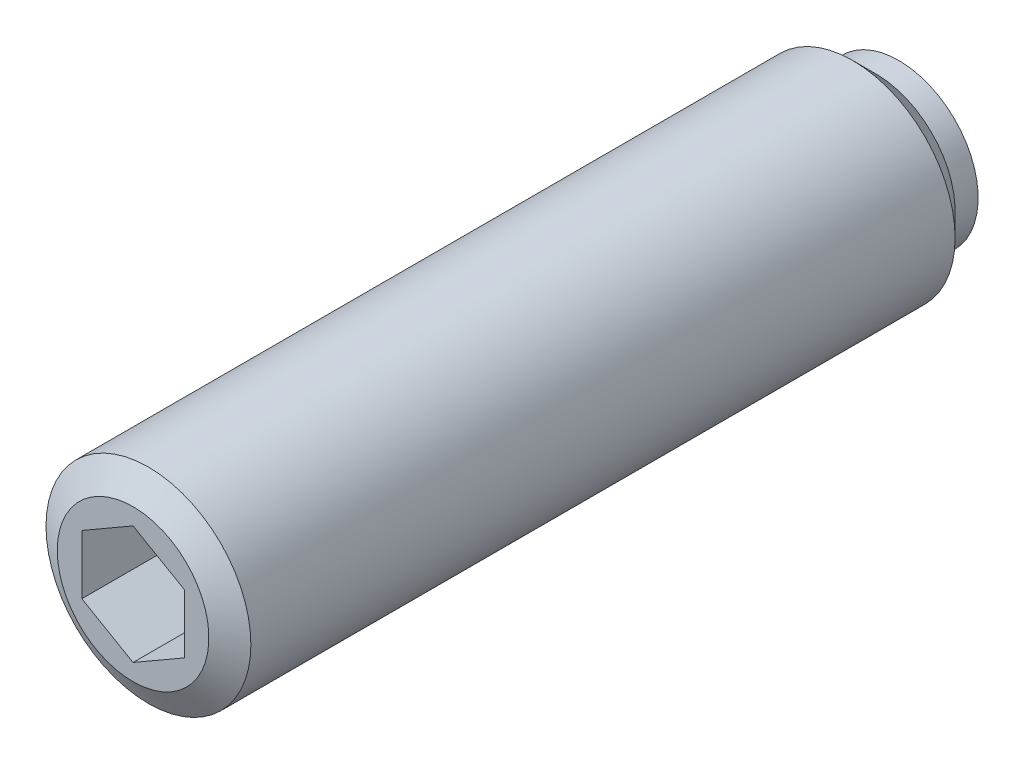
ISO-10303-21;
HEADER;
FILE_DESCRIPTION(('STEP AP214'),'2;1');
FILE_NAME('part.step','',(''),(''),'','','');
FILE_SCHEMA(('AUTOMOTIVE_DESIGN { 1 0 10303 214 1 1 1 1 }'));
ENDSEC;
DATA;
#1=APPLICATION_CONTEXT('core data for automotive mechanical design processes');
#2=APPLICATION_PROTOCOL_DEFINITION('international standard','automotive_design',2000,#1);
#3=PRODUCT_CONTEXT('',#1,'mechanical');
#4=PRODUCT('Part','Part','',(#3));
#5=PRODUCT_RELATED_PRODUCT_CATEGORY('part','',(#4));
#6=PRODUCT_DEFINITION_FORMATION('','',#4);
#7=PRODUCT_DEFINITION_CONTEXT('part definition',#1,'design');
#8=PRODUCT_DEFINITION('design','',#6,#7);
#9=PRODUCT_DEFINITION_SHAPE('','',#8);
#10=(LENGTH_UNIT() NAMED_UNIT(*) SI_UNIT(.MILLI.,.METRE.));
#11=(NAMED_UNIT(*) PLANE_ANGLE_UNIT() SI_UNIT($,.RADIAN.));
#12=(NAMED_UNIT(*) SI_UNIT($,.STERADIAN.) SOLID_ANGLE_UNIT());
#13=UNCERTAINTY_MEASURE_WITH_UNIT(LENGTH_MEASURE(1.E-05),#10,'distance_accuracy_value','');
#14=(GEOMETRIC_REPRESENTATION_CONTEXT(3) GLOBAL_UNCERTAINTY_ASSIGNED_CONTEXT((#13)) GLOBAL_UNIT_ASSIGNED_CONTEXT((#10,
#11,#12)) REPRESENTATION_CONTEXT('',''));
#15=CARTESIAN_POINT('',(0.,0.,0.));
#16=DIRECTION('',(0.,0.,1.));
#17=DIRECTION('',(1.,0.,0.));
#18=AXIS2_PLACEMENT_3D('',#15,#16,#17);
#19=CARTESIAN_POINT('',(0.,2.09621086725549,0.));
#20=DIRECTION('',(0.,0.,1.));
#21=DIRECTION('',(-1.,0.,0.));
#22=AXIS2_PLACEMENT_3D('',#19,#20,#21);
#23=PLANE('',#22);
#24=CARTESIAN_POINT('',(0.,0.,0.));
#25=DIRECTION('',(0.,0.,1.));
#26=DIRECTION('',(-1.,0.,0.));
#27=AXIS2_PLACEMENT_3D('',#24,#25,#26);
#28=CIRCLE('',#27,2.09621086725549);
#29=CARTESIAN_POINT('',(0.,2.09621086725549,0.));
#30=VERTEX_POINT('',#29);
#31=EDGE_CURVE('E9',#30,#30,#28,.T.);
#32=ORIENTED_EDGE('',*,*,#31,.F.);
#33=EDGE_LOOP('',(#32));
#34=FACE_BOUND('',#33,.T.);
#35=ADVANCED_FACE('F14',(#34),#23,.F.);
#36=CARTESIAN_POINT('',(0.,0.,1.78));
#37=DIRECTION('',(0.,0.,1.));
#38=DIRECTION('',(0.,1.,0.));
#39=AXIS2_PLACEMENT_3D('',#36,#37,#38);
#40=SPHERICAL_SURFACE('',#39,2.75);
#41=CARTESIAN_POINT('',(0.,0.,0.5));
#42=DIRECTION('',(0.,0.,1.));
#43=DIRECTION('',(-1.,0.,0.));
#44=AXIS2_PLACEMENT_3D('',#41,#42,#43);
#45=CIRCLE('',#44,2.43394741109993);
#46=CARTESIAN_POINT('',(0.,2.43394741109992,0.5));
#47=VERTEX_POINT('',#46);
#48=EDGE_CURVE('E21',#47,#47,#45,.T.);
#49=CARTESIAN_POINT('',(0.,2.43394741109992,0.5));
#50=CARTESIAN_POINT('',(0.,2.4310160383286,0.494425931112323));
#51=CARTESIAN_POINT('',(0.,2.42806551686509,0.488861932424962));
#52=CARTESIAN_POINT('',(0.,2.42212631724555,0.477754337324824));
#53=CARTESIAN_POINT('',(0.,2.41913763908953,0.472210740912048));
#54=CARTESIAN_POINT('',(0.,2.41312226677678,0.46114421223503));
#55=CARTESIAN_POINT('',(0.,2.41009557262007,0.455621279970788));
#56=CARTESIAN_POINT('',(0.,2.40400431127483,0.444596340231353));
#57=CARTESIAN_POINT('',(0.,2.40093974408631,0.439094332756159));
#58=CARTESIAN_POINT('',(0.,2.39477288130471,0.428111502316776));
#59=CARTESIAN_POINT('',(0.,2.39167058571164,0.422630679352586));
#60=CARTESIAN_POINT('',(0.,2.38542841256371,0.411690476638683));
#61=CARTESIAN_POINT('',(0.,2.38228853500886,0.40623109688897));
#62=CARTESIAN_POINT('',(0.,2.37597134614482,0.39533403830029));
#63=CARTESIAN_POINT('',(0.,2.37279403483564,0.389896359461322));
#64=CARTESIAN_POINT('',(0.,2.36640212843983,0.379042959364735));
#65=CARTESIAN_POINT('',(0.,2.36318753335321,0.373627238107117));
#66=CARTESIAN_POINT('',(0.,2.35672121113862,0.362818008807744));
#67=CARTESIAN_POINT('',(0.,2.35346948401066,0.35742450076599));
#68=CARTESIAN_POINT('',(0.,2.3469290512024,0.346659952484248));
#69=CARTESIAN_POINT('',(0.,2.3436403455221,0.341288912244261));
#70=CARTESIAN_POINT('',(0.,2.3370261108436,0.330569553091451));
#71=CARTESIAN_POINT('',(0.,2.33370058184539,0.325221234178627));
#72=CARTESIAN_POINT('',(0.,2.32701285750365,0.314547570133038));
#73=CARTESIAN_POINT('',(0.,2.32365066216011,0.309222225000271));
#74=CARTESIAN_POINT('',(0.,2.31688976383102,0.298594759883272));
#75=CARTESIAN_POINT('',(0.,2.31349106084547,0.293292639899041));
#76=CARTESIAN_POINT('',(0.,2.30665730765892,0.28271187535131));
#77=CARTESIAN_POINT('',(0.,2.30322225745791,0.277433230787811));
#78=CARTESIAN_POINT('',(0.,2.29631597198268,0.266899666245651));
#79=CARTESIAN_POINT('',(0.,2.29284473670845,0.261644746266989));
#80=CARTESIAN_POINT('',(0.,2.28586624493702,0.251158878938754));
#81=CARTESIAN_POINT('',(0.,2.28235898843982,0.24592793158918));
#82=CARTESIAN_POINT('',(0.,2.27530861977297,0.235490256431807));
#83=CARTESIAN_POINT('',(0.,2.27176550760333,0.230283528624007));
#84=CARTESIAN_POINT('',(0.,2.26464359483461,0.219894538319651));
#85=CARTESIAN_POINT('',(0.,2.26106479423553,0.214712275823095));
#86=CARTESIAN_POINT('',(0.,2.25387167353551,0.204372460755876));
#87=CARTESIAN_POINT('',(0.,2.25025735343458,0.199214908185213));
#88=CARTESIAN_POINT('',(0.,2.24299336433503,0.188924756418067));
#89=CARTESIAN_POINT('',(0.,2.23934369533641,0.183792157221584));
#90=CARTESIAN_POINT('',(0.,2.23200918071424,0.173552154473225));
#91=CARTESIAN_POINT('',(0.,2.22832433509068,0.168444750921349));
#92=CARTESIAN_POINT('',(0.,2.22091964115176,0.158255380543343));
#93=CARTESIAN_POINT('',(0.,2.2171997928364,0.153173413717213));
#94=CARTESIAN_POINT('',(0.,2.20972526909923,0.143035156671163));
#95=CARTESIAN_POINT('',(0.,2.20597059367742,0.137978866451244));
#96=CARTESIAN_POINT('',(0.,2.19842659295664,0.127892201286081));
#97=CARTESIAN_POINT('',(0.,2.19463726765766,0.122861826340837));
#98=CARTESIAN_POINT('',(0.,2.18702414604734,0.112827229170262));
#99=CARTESIAN_POINT('',(0.,2.183200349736,0.10782300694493));
#100=CARTESIAN_POINT('',(0.,2.17551846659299,0.0978409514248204));
#101=CARTESIAN_POINT('',(0.,2.17166037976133,0.0928631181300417));
#102=CARTESIAN_POINT('',(0.,2.16391009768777,0.0829340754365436));
#103=CARTESIAN_POINT('',(0.,2.16001790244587,0.0779828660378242));
#104=CARTESIAN_POINT('',(0.,2.15219958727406,0.0681073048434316));
#105=CARTESIAN_POINT('',(0.,2.14827346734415,0.0631829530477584));
#106=CARTESIAN_POINT('',(0.,2.14038748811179,0.0533613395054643));
#107=CARTESIAN_POINT('',(0.,2.13642762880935,0.0484640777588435));
#108=CARTESIAN_POINT('',(0.,2.12847435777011,0.0386968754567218));
#109=CARTESIAN_POINT('',(0.,2.12448094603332,0.0338269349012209));
#110=CARTESIAN_POINT('',(0.,2.11646075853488,0.024114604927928));
#111=CARTESIAN_POINT('',(0.,2.11243398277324,0.019272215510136));
#112=CARTESIAN_POINT('',(0.,2.10434725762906,0.0096152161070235));
#113=CARTESIAN_POINT('',(0.,2.10028730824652,0.00480060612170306));
#114=CARTESIAN_POINT('',(0.,2.09621086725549,0.));
#115=B_SPLINE_CURVE_WITH_KNOTS('',3,(#49,#50,#51,#52,#53,#54,#55,#56,#57,#58,#59,#60,#61,#62,
#63,#64,#65,#66,#67,#68,#69,#70,#71,#72,#73,#74,#75,#76,#77,#78,#79,#80,#81,#82,#83,#84,#85,#86,
#87,#88,#89,#90,#91,#92,#93,#94,#95,#96,#97,#98,#99,#100,#101,#102,#103,#104,#105,#106,#107,
#108,#109,#110,#111,#112,#113,#114),.UNSPECIFIED.,.F.,.F.,(4,2,2,2,2,2,2,2,2,2,2,2,2,2,2,2,2,2,
2,2,2,2,2,2,2,2,2,2,2,2,2,2,4),(0.,0.0188935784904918,0.0377871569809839,0.0566807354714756,
0.0755743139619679,0.0944678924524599,0.113361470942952,0.132255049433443,0.151148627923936,
0.170042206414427,0.188935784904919,0.207829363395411,0.226722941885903,0.245616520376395,
0.264510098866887,0.283403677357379,0.302297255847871,0.321190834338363,0.340084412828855,
0.358977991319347,0.377871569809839,0.396765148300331,0.415658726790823,0.434552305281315,
0.453445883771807,0.472339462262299,0.491233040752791,0.510126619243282,0.529020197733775,
0.547913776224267,0.566807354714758,0.58570093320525,0.604594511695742),.UNSPECIFIED.);
#116=EDGE_CURVE('BSEAM141',#47,#30,#115,.T.);
#117=ORIENTED_EDGE('',*,*,#48,.F.);
#118=ORIENTED_EDGE('',*,*,#31,.T.);
#119=ORIENTED_EDGE('',*,*,#116,.T.);
#120=ORIENTED_EDGE('',*,*,#116,.F.);
#121=EDGE_LOOP('',(#117,#119,#118,#120));
#122=FACE_BOUND('',#121,.T.);
#123=ADVANCED_FACE('F141',(#122),#40,.T.);
#124=CARTESIAN_POINT('',(0.,3.1,0.5));
#125=DIRECTION('',(0.,0.,1.));
#126=DIRECTION('',(-1.,0.,0.));
#127=AXIS2_PLACEMENT_3D('',#124,#125,#126);
#128=PLANE('',#127);
#129=CARTESIAN_POINT('',(0.,0.,0.5));
#130=DIRECTION('',(0.,0.,1.));
#131=DIRECTION('',(-1.,0.,0.));
#132=AXIS2_PLACEMENT_3D('',#129,#130,#131);
#133=CIRCLE('',#132,3.1);
#134=CARTESIAN_POINT('',(-3.1,0.,0.5));
#135=VERTEX_POINT('',#134);
#136=EDGE_CURVE('E134',#135,#135,#133,.T.);
#137=ORIENTED_EDGE('',*,*,#136,.F.);
#138=EDGE_LOOP('',(#137));
#139=FACE_BOUND('',#138,.T.);
#140=ORIENTED_EDGE('',*,*,#48,.T.);
#141=EDGE_LOOP('',(#140));
#142=FACE_BOUND('',#141,.T.);
#143=ADVANCED_FACE('F139',(#139,#142),#128,.F.);
#144=CARTESIAN_POINT('',(0.,0.,31.7950749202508));
#145=DIRECTION('',(0.,0.,1.));
#146=DIRECTION('',(-1.,0.,0.));
#147=AXIS2_PLACEMENT_3D('',#144,#145,#146);
#148=CYLINDRICAL_SURFACE('',#147,3.1);
#149=CARTESIAN_POINT('',(0.,0.,1.4));
#150=DIRECTION('',(0.,0.,1.));
#151=DIRECTION('',(-1.,0.,0.));
#152=AXIS2_PLACEMENT_3D('',#149,#150,#151);
#153=CIRCLE('',#152,3.1);
#154=CARTESIAN_POINT('',(-3.1,0.,1.4));
#155=VERTEX_POINT('',#154);
#156=EDGE_CURVE('E131',#155,#155,#153,.T.);
#157=ORIENTED_EDGE('',*,*,#156,.F.);
#158=EDGE_LOOP('',(#157));
#159=FACE_BOUND('',#158,.T.);
#160=ORIENTED_EDGE('',*,*,#136,.T.);
#161=EDGE_LOOP('',(#160));
#162=FACE_BOUND('',#161,.T.);
#163=ADVANCED_FACE('F164',(#159,#162),#148,.T.);
#164=CARTESIAN_POINT('',(0.,0.,1.4));
#165=DIRECTION('',(0.,0.,1.));
#166=DIRECTION('',(-1.,0.,0.));
#167=AXIS2_PLACEMENT_3D('',#164,#165,#166);
#168=CONICAL_SURFACE('',#167,3.1,0.78539816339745);
#169=CARTESIAN_POINT('',(0.,0.,2.3));
#170=DIRECTION('',(0.,0.,1.));
#171=DIRECTION('',(-1.,0.,0.));
#172=AXIS2_PLACEMENT_3D('',#169,#170,#171);
#173=CIRCLE('',#172,4.);
#174=CARTESIAN_POINT('',(-4.,0.,2.3));
#175=VERTEX_POINT('',#174);
#176=EDGE_CURVE('E128',#175,#175,#173,.T.);
#177=ORIENTED_EDGE('',*,*,#176,.F.);
#178=EDGE_LOOP('',(#177));
#179=FACE_BOUND('',#178,.T.);
#180=ORIENTED_EDGE('',*,*,#156,.T.);
#181=EDGE_LOOP('',(#180));
#182=FACE_BOUND('',#181,.T.);
#183=ADVANCED_FACE('F173',(#179,#182),#168,.T.);
#184=CARTESIAN_POINT('',(0.,0.,31.7950749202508));
#185=DIRECTION('',(0.,0.,1.));
#186=DIRECTION('',(-1.,0.,0.));
#187=AXIS2_PLACEMENT_3D('',#184,#185,#186);
#188=CYLINDRICAL_SURFACE('',#187,4.);
#189=CARTESIAN_POINT('',(0.,0.,29.8));
#190=DIRECTION('',(0.,0.,1.));
#191=DIRECTION('',(-1.,0.,0.));
#192=AXIS2_PLACEMENT_3D('',#189,#190,#191);
#193=CIRCLE('',#192,4.);
#194=CARTESIAN_POINT('',(-4.,0.,29.8));
#195=VERTEX_POINT('',#194);
#196=EDGE_CURVE('E125',#195,#195,#193,.T.);
#197=ORIENTED_EDGE('',*,*,#196,.F.);
#198=EDGE_LOOP('',(#197));
#199=FACE_BOUND('',#198,.T.);
#200=ORIENTED_EDGE('',*,*,#176,.T.);
#201=EDGE_LOOP('',(#200));
#202=FACE_BOUND('',#201,.T.);
#203=ADVANCED_FACE('F182',(#199,#202),#188,.T.);
#204=CARTESIAN_POINT('',(0.,0.,29.8));
#205=DIRECTION('',(0.,0.,-1.));
#206=DIRECTION('',(1.,0.,0.));
#207=AXIS2_PLACEMENT_3D('',#204,#205,#206);
#208=CONICAL_SURFACE('',#207,4.,1.04719755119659);
#209=CARTESIAN_POINT('',(0.,0.,30.4));
#210=DIRECTION('',(0.,0.,1.));
#211=DIRECTION('',(-1.,0.,0.));
#212=AXIS2_PLACEMENT_3D('',#209,#210,#211);
#213=CIRCLE('',#212,2.96076951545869);
#214=CARTESIAN_POINT('',(-2.96076951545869,0.,30.4));
#215=VERTEX_POINT('',#214);
#216=EDGE_CURVE('E116',#215,#215,#213,.T.);
#217=ORIENTED_EDGE('',*,*,#216,.F.);
#218=EDGE_LOOP('',(#217));
#219=FACE_BOUND('',#218,.T.);
#220=ORIENTED_EDGE('',*,*,#196,.T.);
#221=EDGE_LOOP('',(#220));
#222=FACE_BOUND('',#221,.T.);
#223=ADVANCED_FACE('F191',(#219,#222),#208,.T.);
#224=CARTESIAN_POINT('',(0.,0.,30.4));
#225=DIRECTION('',(0.,0.,-1.));
#226=DIRECTION('',(1.,0.,0.));
#227=AXIS2_PLACEMENT_3D('',#224,#225,#226);
#228=PLANE('',#227);
#229=DIRECTION('',(-0.866025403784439,-0.5,0.));
#230=VECTOR('',#229,1.);
#231=CARTESIAN_POINT('',(0.,2.30940107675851,30.4));
#232=LINE('',#231,#230);
#233=CARTESIAN_POINT('',(0.,2.30940107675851,30.4));
#234=VERTEX_POINT('',#233);
#235=CARTESIAN_POINT('',(-2.,1.15470053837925,30.4));
#236=VERTEX_POINT('',#235);
#237=EDGE_CURVE('E82',#234,#236,#232,.T.);
#238=ORIENTED_EDGE('',*,*,#237,.F.);
#239=DIRECTION('',(-0.866025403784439,0.5,0.));
#240=VECTOR('',#239,1.);
#241=CARTESIAN_POINT('',(2.,1.15470053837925,30.4));
#242=LINE('',#241,#240);
#243=CARTESIAN_POINT('',(2.,1.15470053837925,30.4));
#244=VERTEX_POINT('',#243);
#245=EDGE_CURVE('E28',#244,#234,#242,.T.);
#246=ORIENTED_EDGE('',*,*,#245,.F.);
#247=DIRECTION('',(0.,1.,0.));
#248=VECTOR('',#247,1.);
#249=CARTESIAN_POINT('',(2.,-1.15470053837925,30.4));
#250=LINE('',#249,#248);
#251=CARTESIAN_POINT('',(2.,-1.15470053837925,30.4));
#252=VERTEX_POINT('',#251);
#253=EDGE_CURVE('E98',#252,#244,#250,.T.);
#254=ORIENTED_EDGE('',*,*,#253,.F.);
#255=DIRECTION('',(0.866025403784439,0.5,0.));
#256=VECTOR('',#255,1.);
#257=CARTESIAN_POINT('',(0.,-2.30940107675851,30.4));
#258=LINE('',#257,#256);
#259=CARTESIAN_POINT('',(0.,-2.30940107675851,30.4));
#260=VERTEX_POINT('',#259);
#261=EDGE_CURVE('E92',#260,#252,#258,.T.);
#262=ORIENTED_EDGE('',*,*,#261,.F.);
#263=DIRECTION('',(0.866025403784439,-0.5,0.));
#264=VECTOR('',#263,1.);
#265=CARTESIAN_POINT('',(-2.,-1.15470053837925,30.4));
#266=LINE('',#265,#264);
#267=CARTESIAN_POINT('',(-2.,-1.15470053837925,30.4));
#268=VERTEX_POINT('',#267);
#269=EDGE_CURVE('E90',#268,#260,#266,.T.);
#270=ORIENTED_EDGE('',*,*,#269,.F.);
#271=DIRECTION('',(0.,-1.,0.));
#272=VECTOR('',#271,1.);
#273=CARTESIAN_POINT('',(-2.,1.15470053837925,30.4));
#274=LINE('',#273,#272);
#275=EDGE_CURVE('E71',#236,#268,#274,.T.);
#276=ORIENTED_EDGE('',*,*,#275,.F.);
#277=EDGE_LOOP('',(#238,#246,#254,#262,#270,#276));
#278=FACE_BOUND('',#277,.T.);
#279=ORIENTED_EDGE('',*,*,#216,.T.);
#280=EDGE_LOOP('',(#279));
#281=FACE_BOUND('',#280,.T.);
#282=ADVANCED_FACE('F86',(#278,#281),#228,.F.);
#283=CARTESIAN_POINT('',(2.,1.15470053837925,26.4));
#284=DIRECTION('',(0.5,0.866025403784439,0.));
#285=DIRECTION('',(0.866025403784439,-0.5,0.));
#286=AXIS2_PLACEMENT_3D('',#283,#284,#285);
#287=PLANE('',#286);
#288=ORIENTED_EDGE('',*,*,#245,.T.);
#289=DIRECTION('',(0.,0.,1.));
#290=VECTOR('',#289,1.);
#291=CARTESIAN_POINT('',(0.,2.30940107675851,26.4));
#292=LINE('',#291,#290);
#293=CARTESIAN_POINT('',(0.,2.30940107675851,26.4));
#294=VERTEX_POINT('',#293);
#295=EDGE_CURVE('E79',#294,#234,#292,.T.);
#296=ORIENTED_EDGE('',*,*,#295,.F.);
#297=DIRECTION('',(-0.866025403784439,0.5,0.));
#298=VECTOR('',#297,1.);
#299=CARTESIAN_POINT('',(2.,1.15470053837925,26.4));
#300=LINE('',#299,#298);
#301=CARTESIAN_POINT('',(2.,1.15470053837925,26.4));
#302=VERTEX_POINT('',#301);
#303=EDGE_CURVE('E100',#302,#294,#300,.T.);
#304=ORIENTED_EDGE('',*,*,#303,.F.);
#305=DIRECTION('',(0.,0.,1.));
#306=VECTOR('',#305,1.);
#307=CARTESIAN_POINT('',(2.,1.15470053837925,26.4));
#308=LINE('',#307,#306);
#309=EDGE_CURVE('E35',#302,#244,#308,.T.);
#310=ORIENTED_EDGE('',*,*,#309,.T.);
#311=EDGE_LOOP('',(#288,#296,#304,#310));
#312=FACE_BOUND('',#311,.T.);
#313=ADVANCED_FACE('F208',(#312),#287,.F.);
#314=CARTESIAN_POINT('',(2.,-1.15470053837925,26.4));
#315=DIRECTION('',(1.,0.,0.));
#316=DIRECTION('',(0.,0.,1.));
#317=AXIS2_PLACEMENT_3D('',#314,#315,#316);
#318=PLANE('',#317);
#319=ORIENTED_EDGE('',*,*,#253,.T.);
#320=ORIENTED_EDGE('',*,*,#309,.F.);
#321=DIRECTION('',(0.,1.,0.));
#322=VECTOR('',#321,1.);
#323=CARTESIAN_POINT('',(2.,-1.15470053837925,26.4));
#324=LINE('',#323,#322);
#325=CARTESIAN_POINT('',(2.,-1.15470053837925,26.4));
#326=VERTEX_POINT('',#325);
#327=EDGE_CURVE('E112',#326,#302,#324,.T.);
#328=ORIENTED_EDGE('',*,*,#327,.F.);
#329=DIRECTION('',(0.,0.,1.));
#330=VECTOR('',#329,1.);
#331=CARTESIAN_POINT('',(2.,-1.15470053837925,26.4));
#332=LINE('',#331,#330);
#333=EDGE_CURVE('E117',#326,#252,#332,.T.);
#334=ORIENTED_EDGE('',*,*,#333,.T.);
#335=EDGE_LOOP('',(#319,#320,#328,#334));
#336=FACE_BOUND('',#335,.T.);
#337=ADVANCED_FACE('F216',(#336),#318,.F.);
#338=CARTESIAN_POINT('',(0.,-2.30940107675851,26.4));
#339=DIRECTION('',(0.5,-0.866025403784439,0.));
#340=DIRECTION('',(-0.866025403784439,-0.5,0.));
#341=AXIS2_PLACEMENT_3D('',#338,#339,#340);
#342=PLANE('',#341);
#343=ORIENTED_EDGE('',*,*,#261,.T.);
#344=ORIENTED_EDGE('',*,*,#333,.F.);
#345=DIRECTION('',(0.866025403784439,0.5,0.));
#346=VECTOR('',#345,1.);
#347=CARTESIAN_POINT('',(0.,-2.30940107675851,26.4));
#348=LINE('',#347,#346);
#349=CARTESIAN_POINT('',(0.,-2.30940107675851,26.4));
#350=VERTEX_POINT('',#349);
#351=EDGE_CURVE('E109',#350,#326,#348,.T.);
#352=ORIENTED_EDGE('',*,*,#351,.F.);
#353=DIRECTION('',(0.,0.,1.));
#354=VECTOR('',#353,1.);
#355=CARTESIAN_POINT('',(0.,-2.30940107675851,26.4));
#356=LINE('',#355,#354);
#357=EDGE_CURVE('E119',#350,#260,#356,.T.);
#358=ORIENTED_EDGE('',*,*,#357,.T.);
#359=EDGE_LOOP('',(#343,#344,#352,#358));
#360=FACE_BOUND('',#359,.T.);
#361=ADVANCED_FACE('F224',(#360),#342,.F.);
#362=CARTESIAN_POINT('',(-2.,-1.15470053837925,26.4));
#363=DIRECTION('',(-0.5,-0.866025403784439,0.));
#364=DIRECTION('',(-0.866025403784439,0.5,0.));
#365=AXIS2_PLACEMENT_3D('',#362,#363,#364);
#366=PLANE('',#365);
#367=ORIENTED_EDGE('',*,*,#269,.T.);
#368=ORIENTED_EDGE('',*,*,#357,.F.);
#369=DIRECTION('',(0.866025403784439,-0.5,0.));
#370=VECTOR('',#369,1.);
#371=CARTESIAN_POINT('',(-2.,-1.15470053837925,26.4));
#372=LINE('',#371,#370);
#373=CARTESIAN_POINT('',(-2.,-1.15470053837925,26.4));
#374=VERTEX_POINT('',#373);
#375=EDGE_CURVE('E106',#374,#350,#372,.T.);
#376=ORIENTED_EDGE('',*,*,#375,.F.);
#377=DIRECTION('',(0.,0.,1.));
#378=VECTOR('',#377,1.);
#379=CARTESIAN_POINT('',(-2.,-1.15470053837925,26.4));
#380=LINE('',#379,#378);
#381=EDGE_CURVE('E78',#374,#268,#380,.T.);
#382=ORIENTED_EDGE('',*,*,#381,.T.);
#383=EDGE_LOOP('',(#367,#368,#376,#382));
#384=FACE_BOUND('',#383,.T.);
#385=ADVANCED_FACE('F232',(#384),#366,.F.);
#386=CARTESIAN_POINT('',(-2.,1.15470053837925,26.4));
#387=DIRECTION('',(-1.,0.,0.));
#388=DIRECTION('',(0.,1.,0.));
#389=AXIS2_PLACEMENT_3D('',#386,#387,#388);
#390=PLANE('',#389);
#391=ORIENTED_EDGE('',*,*,#275,.T.);
#392=ORIENTED_EDGE('',*,*,#381,.F.);
#393=DIRECTION('',(0.,-1.,0.));
#394=VECTOR('',#393,1.);
#395=CARTESIAN_POINT('',(-2.,1.15470053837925,26.4));
#396=LINE('',#395,#394);
#397=CARTESIAN_POINT('',(-2.,1.15470053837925,26.4));
#398=VERTEX_POINT('',#397);
#399=EDGE_CURVE('E74',#398,#374,#396,.T.);
#400=ORIENTED_EDGE('',*,*,#399,.F.);
#401=DIRECTION('',(0.,0.,1.));
#402=VECTOR('',#401,1.);
#403=CARTESIAN_POINT('',(-2.,1.15470053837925,26.4));
#404=LINE('',#403,#402);
#405=EDGE_CURVE('E67',#398,#236,#404,.T.);
#406=ORIENTED_EDGE('',*,*,#405,.T.);
#407=EDGE_LOOP('',(#391,#392,#400,#406));
#408=FACE_BOUND('',#407,.T.);
#409=ADVANCED_FACE('F69',(#408),#390,.F.);
#410=CARTESIAN_POINT('',(0.,2.30940107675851,26.4));
#411=DIRECTION('',(-0.5,0.866025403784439,0.));
#412=DIRECTION('',(0.866025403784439,0.5,0.));
#413=AXIS2_PLACEMENT_3D('',#410,#411,#412);
#414=PLANE('',#413);
#415=ORIENTED_EDGE('',*,*,#237,.T.);
#416=ORIENTED_EDGE('',*,*,#405,.F.);
#417=DIRECTION('',(-0.866025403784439,-0.5,0.));
#418=VECTOR('',#417,1.);
#419=CARTESIAN_POINT('',(0.,2.30940107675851,26.4));
#420=LINE('',#419,#418);
#421=EDGE_CURVE('E103',#294,#398,#420,.T.);
#422=ORIENTED_EDGE('',*,*,#421,.F.);
#423=ORIENTED_EDGE('',*,*,#295,.T.);
#424=EDGE_LOOP('',(#415,#416,#422,#423));
#425=FACE_BOUND('',#424,.T.);
#426=ADVANCED_FACE('F83',(#425),#414,.F.);
#427=CARTESIAN_POINT('',(2.,1.15470053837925,26.4));
#428=DIRECTION('',(0.,0.,-1.));
#429=DIRECTION('',(1.,0.,0.));
#430=AXIS2_PLACEMENT_3D('',#427,#428,#429);
#431=PLANE('',#430);
#432=ORIENTED_EDGE('',*,*,#303,.T.);
#433=ORIENTED_EDGE('',*,*,#421,.T.);
#434=ORIENTED_EDGE('',*,*,#399,.T.);
#435=ORIENTED_EDGE('',*,*,#375,.T.);
#436=ORIENTED_EDGE('',*,*,#351,.T.);
#437=ORIENTED_EDGE('',*,*,#327,.T.);
#438=EDGE_LOOP('',(#432,#433,#434,#435,#436,#437));
#439=FACE_BOUND('',#438,.T.);
#440=ADVANCED_FACE('F256',(#439),#431,.F.);
#441=CLOSED_SHELL('',(#35,#123,#143,#163,#183,#203,#223,#282,#313,#337,#361,#385,#409,#426,#440));
#442=MANIFOLD_SOLID_BREP('B1',#441);
#443=ADVANCED_BREP_SHAPE_REPRESENTATION('',(#18,#442),#14);
#444=SHAPE_DEFINITION_REPRESENTATION(#9,#443);
ENDSEC;
END-ISO-10303-21;
